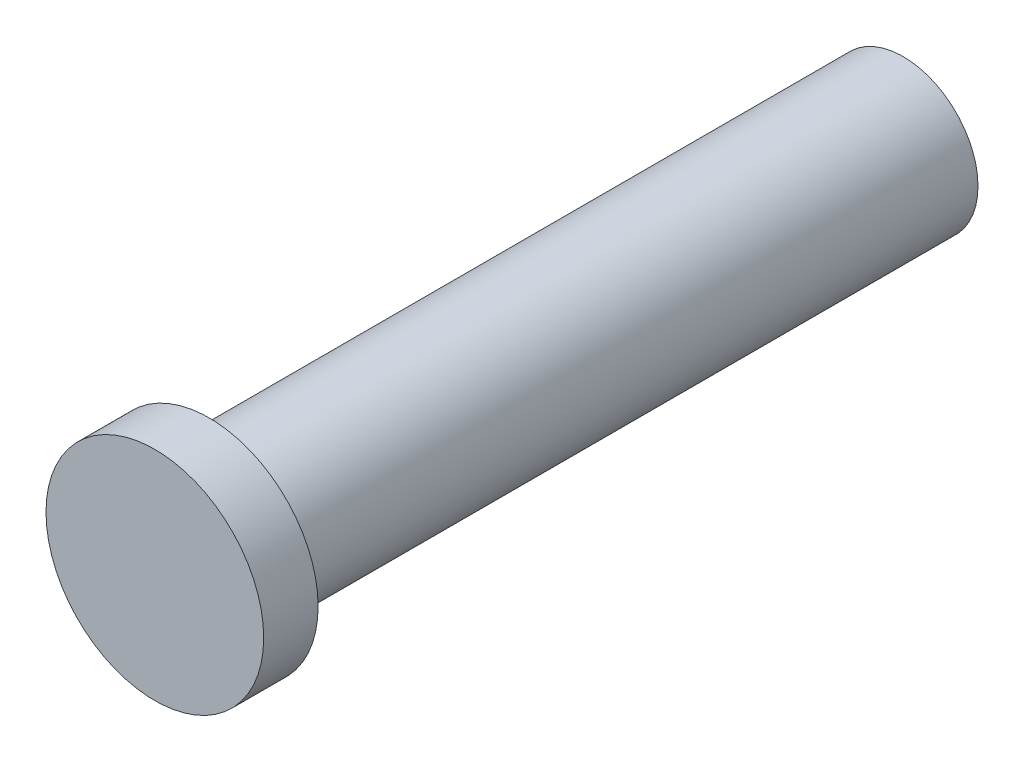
ISO-10303-21;
HEADER;
FILE_DESCRIPTION(('STEP AP214'),'2;1');
FILE_NAME('part.step','',(''),(''),'','','');
FILE_SCHEMA(('AUTOMOTIVE_DESIGN { 1 0 10303 214 1 1 1 1 }'));
ENDSEC;
DATA;
#1=APPLICATION_CONTEXT('core data for automotive mechanical design processes');
#2=APPLICATION_PROTOCOL_DEFINITION('international standard','automotive_design',2000,#1);
#3=PRODUCT_CONTEXT('',#1,'mechanical');
#4=PRODUCT('Part','Part','',(#3));
#5=PRODUCT_RELATED_PRODUCT_CATEGORY('part','',(#4));
#6=PRODUCT_DEFINITION_FORMATION('','',#4);
#7=PRODUCT_DEFINITION_CONTEXT('part definition',#1,'design');
#8=PRODUCT_DEFINITION('design','',#6,#7);
#9=PRODUCT_DEFINITION_SHAPE('','',#8);
#10=(LENGTH_UNIT() NAMED_UNIT(*) SI_UNIT(.MILLI.,.METRE.));
#11=(NAMED_UNIT(*) PLANE_ANGLE_UNIT() SI_UNIT($,.RADIAN.));
#12=(NAMED_UNIT(*) SI_UNIT($,.STERADIAN.) SOLID_ANGLE_UNIT());
#13=UNCERTAINTY_MEASURE_WITH_UNIT(LENGTH_MEASURE(1.E-05),#10,'distance_accuracy_value','');
#14=(GEOMETRIC_REPRESENTATION_CONTEXT(3) GLOBAL_UNCERTAINTY_ASSIGNED_CONTEXT((#13)) GLOBAL_UNIT_ASSIGNED_CONTEXT((#10,
#11,#12)) REPRESENTATION_CONTEXT('',''));
#15=CARTESIAN_POINT('',(0.,0.,0.));
#16=DIRECTION('',(0.,0.,1.));
#17=DIRECTION('',(1.,0.,0.));
#18=AXIS2_PLACEMENT_3D('',#15,#16,#17);
#19=CARTESIAN_POINT('',(0.,0.,51.));
#20=DIRECTION('',(0.,0.,-1.));
#21=DIRECTION('',(-1.,0.,0.));
#22=AXIS2_PLACEMENT_3D('',#19,#20,#21);
#23=CYLINDRICAL_SURFACE('',#22,5.5);
#24=CARTESIAN_POINT('',(0.,0.,51.));
#25=DIRECTION('',(0.,0.,1.));
#26=DIRECTION('',(1.,0.,0.));
#27=AXIS2_PLACEMENT_3D('',#24,#25,#26);
#28=CIRCLE('',#27,5.5);
#29=CARTESIAN_POINT('',(5.5,0.,51.));
#30=VERTEX_POINT('',#29);
#31=EDGE_CURVE('E11',#30,#30,#28,.T.);
#32=ORIENTED_EDGE('',*,*,#31,.F.);
#33=EDGE_LOOP('',(#32));
#34=FACE_BOUND('',#33,.T.);
#35=CARTESIAN_POINT('',(0.,0.,0.));
#36=DIRECTION('',(0.,0.,1.));
#37=DIRECTION('',(1.,0.,0.));
#38=AXIS2_PLACEMENT_3D('',#35,#36,#37);
#39=CIRCLE('',#38,5.5);
#40=CARTESIAN_POINT('',(5.5,0.,0.));
#41=VERTEX_POINT('',#40);
#42=EDGE_CURVE('E43',#41,#41,#39,.T.);
#43=ORIENTED_EDGE('',*,*,#42,.T.);
#44=EDGE_LOOP('',(#43));
#45=FACE_BOUND('',#44,.T.);
#46=ADVANCED_FACE('F40',(#34,#45),#23,.T.);
#47=CARTESIAN_POINT('',(0.,0.,0.));
#48=DIRECTION('',(0.,0.,1.));
#49=DIRECTION('',(1.,0.,0.));
#50=AXIS2_PLACEMENT_3D('',#47,#48,#49);
#51=PLANE('',#50);
#52=CARTESIAN_POINT('',(0.,0.,0.));
#53=DIRECTION('',(0.,0.,-1.));
#54=DIRECTION('',(-1.,0.,0.));
#55=AXIS2_PLACEMENT_3D('',#52,#53,#54);
#56=CIRCLE('',#55,2.1);
#57=CARTESIAN_POINT('',(-2.1,0.,0.));
#58=VERTEX_POINT('',#57);
#59=EDGE_CURVE('E60',#58,#58,#56,.T.);
#60=ORIENTED_EDGE('',*,*,#59,.F.);
#61=EDGE_LOOP('',(#60));
#62=FACE_BOUND('',#61,.T.);
#63=ORIENTED_EDGE('',*,*,#42,.F.);
#64=EDGE_LOOP('',(#63));
#65=FACE_BOUND('',#64,.T.);
#66=ADVANCED_FACE('F75',(#62,#65),#51,.F.);
#67=CARTESIAN_POINT('',(0.,0.,55.));
#68=DIRECTION('',(0.,0.,-1.));
#69=DIRECTION('',(-1.,0.,0.));
#70=AXIS2_PLACEMENT_3D('',#67,#68,#69);
#71=CYLINDRICAL_SURFACE('',#70,8.);
#72=CARTESIAN_POINT('',(0.,0.,55.));
#73=DIRECTION('',(0.,0.,1.));
#74=DIRECTION('',(1.,0.,0.));
#75=AXIS2_PLACEMENT_3D('',#72,#73,#74);
#76=CIRCLE('',#75,8.);
#77=CARTESIAN_POINT('',(8.,0.,55.));
#78=VERTEX_POINT('',#77);
#79=EDGE_CURVE('E63',#78,#78,#76,.T.);
#80=ORIENTED_EDGE('',*,*,#79,.F.);
#81=EDGE_LOOP('',(#80));
#82=FACE_BOUND('',#81,.T.);
#83=CARTESIAN_POINT('',(0.,0.,51.));
#84=DIRECTION('',(0.,0.,1.));
#85=DIRECTION('',(1.,0.,0.));
#86=AXIS2_PLACEMENT_3D('',#83,#84,#85);
#87=CIRCLE('',#86,8.);
#88=CARTESIAN_POINT('',(8.,0.,51.));
#89=VERTEX_POINT('',#88);
#90=EDGE_CURVE('E59',#89,#89,#87,.T.);
#91=ORIENTED_EDGE('',*,*,#90,.T.);
#92=EDGE_LOOP('',(#91));
#93=FACE_BOUND('',#92,.T.);
#94=ADVANCED_FACE('F77',(#82,#93),#71,.T.);
#95=CARTESIAN_POINT('',(0.,0.,55.));
#96=DIRECTION('',(0.,0.,1.));
#97=DIRECTION('',(1.,0.,0.));
#98=AXIS2_PLACEMENT_3D('',#95,#96,#97);
#99=PLANE('',#98);
#100=ORIENTED_EDGE('',*,*,#79,.T.);
#101=EDGE_LOOP('',(#100));
#102=FACE_BOUND('',#101,.T.);
#103=ADVANCED_FACE('F83',(#102),#99,.T.);
#104=CARTESIAN_POINT('',(0.,0.,51.));
#105=DIRECTION('',(0.,0.,1.));
#106=DIRECTION('',(1.,0.,0.));
#107=AXIS2_PLACEMENT_3D('',#104,#105,#106);
#108=PLANE('',#107);
#109=ORIENTED_EDGE('',*,*,#31,.T.);
#110=EDGE_LOOP('',(#109));
#111=FACE_BOUND('',#110,.T.);
#112=ORIENTED_EDGE('',*,*,#90,.F.);
#113=EDGE_LOOP('',(#112));
#114=FACE_BOUND('',#113,.T.);
#115=ADVANCED_FACE('F53',(#111,#114),#108,.F.);
#116=CARTESIAN_POINT('',(0.,0.,14.));
#117=DIRECTION('',(0.,0.,-1.));
#118=DIRECTION('',(-1.,0.,0.));
#119=AXIS2_PLACEMENT_3D('',#116,#117,#118);
#120=CONICAL_SURFACE('',#119,2.1,1.02974425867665);
#121=CARTESIAN_POINT('',(0.,0.,15.2618072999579));
#122=VERTEX_POINT('',#121);
#123=VERTEX_LOOP('',#122);
#124=FACE_BOUND('',#123,.T.);
#125=CARTESIAN_POINT('',(0.,0.,14.));
#126=DIRECTION('',(0.,0.,-1.));
#127=DIRECTION('',(-1.,0.,0.));
#128=AXIS2_PLACEMENT_3D('',#125,#126,#127);
#129=CIRCLE('',#128,2.1);
#130=CARTESIAN_POINT('',(-2.1,0.,14.));
#131=VERTEX_POINT('',#130);
#132=EDGE_CURVE('E57',#131,#131,#129,.T.);
#133=ORIENTED_EDGE('',*,*,#132,.T.);
#134=EDGE_LOOP('',(#133));
#135=FACE_BOUND('',#134,.T.);
#136=ADVANCED_FACE('F49',(#124,#135),#120,.F.);
#137=CARTESIAN_POINT('',(0.,0.,0.));
#138=DIRECTION('',(0.,0.,-1.));
#139=DIRECTION('',(-1.,0.,0.));
#140=AXIS2_PLACEMENT_3D('',#137,#138,#139);
#141=CYLINDRICAL_SURFACE('',#140,2.1);
#142=ORIENTED_EDGE('',*,*,#132,.F.);
#143=EDGE_LOOP('',(#142));
#144=FACE_BOUND('',#143,.T.);
#145=ORIENTED_EDGE('',*,*,#59,.T.);
#146=EDGE_LOOP('',(#145));
#147=FACE_BOUND('',#146,.T.);
#148=ADVANCED_FACE('F52',(#144,#147),#141,.F.);
#149=CLOSED_SHELL('',(#46,#66,#94,#103,#115,#136,#148));
#150=MANIFOLD_SOLID_BREP('B2',#149);
#151=ADVANCED_BREP_SHAPE_REPRESENTATION('',(#18,#150),#14);
#152=SHAPE_DEFINITION_REPRESENTATION(#9,#151);
ENDSEC;
END-ISO-10303-21;
